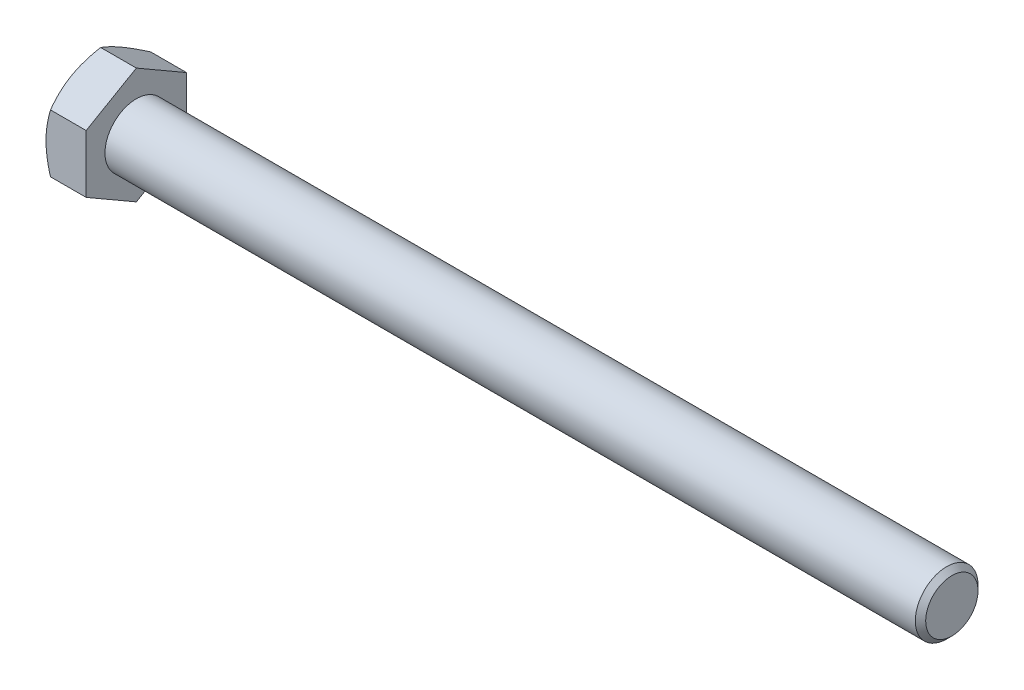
ISO-10303-21;
HEADER;
FILE_DESCRIPTION(('STEP AP214'),'2;1');
FILE_NAME('part.step','',(''),(''),'','','');
FILE_SCHEMA(('AUTOMOTIVE_DESIGN { 1 0 10303 214 1 1 1 1 }'));
ENDSEC;
DATA;
#1=APPLICATION_CONTEXT('core data for automotive mechanical design processes');
#2=APPLICATION_PROTOCOL_DEFINITION('international standard','automotive_design',2000,#1);
#3=PRODUCT_CONTEXT('',#1,'mechanical');
#4=PRODUCT('Part','Part','',(#3));
#5=PRODUCT_RELATED_PRODUCT_CATEGORY('part','',(#4));
#6=PRODUCT_DEFINITION_FORMATION('','',#4);
#7=PRODUCT_DEFINITION_CONTEXT('part definition',#1,'design');
#8=PRODUCT_DEFINITION('design','',#6,#7);
#9=PRODUCT_DEFINITION_SHAPE('','',#8);
#10=(LENGTH_UNIT() NAMED_UNIT(*) SI_UNIT(.MILLI.,.METRE.));
#11=(NAMED_UNIT(*) PLANE_ANGLE_UNIT() SI_UNIT($,.RADIAN.));
#12=(NAMED_UNIT(*) SI_UNIT($,.STERADIAN.) SOLID_ANGLE_UNIT());
#13=UNCERTAINTY_MEASURE_WITH_UNIT(LENGTH_MEASURE(1.E-05),#10,'distance_accuracy_value','');
#14=(GEOMETRIC_REPRESENTATION_CONTEXT(3) GLOBAL_UNCERTAINTY_ASSIGNED_CONTEXT((#13)) GLOBAL_UNIT_ASSIGNED_CONTEXT((#10,
#11,#12)) REPRESENTATION_CONTEXT('',''));
#15=CARTESIAN_POINT('',(0.,0.,0.));
#16=DIRECTION('',(0.,0.,1.));
#17=DIRECTION('',(1.,0.,0.));
#18=AXIS2_PLACEMENT_3D('',#15,#16,#17);
#19=CARTESIAN_POINT('',(0.,9.23760430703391,1.11022302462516E-13));
#20=DIRECTION('',(1.,0.,0.));
#21=DIRECTION('',(0.,1.,0.));
#22=AXIS2_PLACEMENT_3D('',#19,#20,#21);
#23=PLANE('',#22);
#24=CARTESIAN_POINT('',(0.,0.,0.));
#25=DIRECTION('',(1.,0.,0.));
#26=DIRECTION('',(0.,1.,0.));
#27=AXIS2_PLACEMENT_3D('',#24,#25,#26);
#28=CIRCLE('',#27,8.00000000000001);
#29=CARTESIAN_POINT('',(0.,-6.92820323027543,-4.));
#30=VERTEX_POINT('',#29);
#31=CARTESIAN_POINT('',(0.,0.,-7.9999999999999));
#32=VERTEX_POINT('',#31);
#33=EDGE_CURVE('E342',#30,#32,#28,.T.);
#34=ORIENTED_EDGE('',*,*,#33,.F.);
#35=CARTESIAN_POINT('',(0.,0.,0.));
#36=DIRECTION('',(1.,0.,0.));
#37=DIRECTION('',(0.,1.,0.));
#38=AXIS2_PLACEMENT_3D('',#35,#36,#37);
#39=CIRCLE('',#38,8.00000000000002);
#40=CARTESIAN_POINT('',(0.,-6.92820323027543,4.));
#41=VERTEX_POINT('',#40);
#42=EDGE_CURVE('E341',#41,#30,#39,.T.);
#43=ORIENTED_EDGE('',*,*,#42,.F.);
#44=CARTESIAN_POINT('',(0.,0.,0.));
#45=DIRECTION('',(1.,0.,0.));
#46=DIRECTION('',(0.,1.,0.));
#47=AXIS2_PLACEMENT_3D('',#44,#45,#46);
#48=CIRCLE('',#47,8.00000000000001);
#49=CARTESIAN_POINT('',(0.,0.,8.00000000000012));
#50=VERTEX_POINT('',#49);
#51=EDGE_CURVE('E91',#50,#41,#48,.T.);
#52=ORIENTED_EDGE('',*,*,#51,.F.);
#53=CARTESIAN_POINT('',(0.,0.,0.));
#54=DIRECTION('',(1.,0.,0.));
#55=DIRECTION('',(0.,1.,0.));
#56=AXIS2_PLACEMENT_3D('',#53,#54,#55);
#57=CIRCLE('',#56,8.);
#58=CARTESIAN_POINT('',(0.,6.92820323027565,4.00000000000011));
#59=VERTEX_POINT('',#58);
#60=EDGE_CURVE('E89',#59,#50,#57,.T.);
#61=ORIENTED_EDGE('',*,*,#60,.F.);
#62=CARTESIAN_POINT('',(0.,0.,0.));
#63=DIRECTION('',(1.,0.,0.));
#64=DIRECTION('',(0.,1.,0.));
#65=AXIS2_PLACEMENT_3D('',#62,#63,#64);
#66=CIRCLE('',#65,8.);
#67=CARTESIAN_POINT('',(0.,6.92820323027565,-4.));
#68=VERTEX_POINT('',#67);
#69=EDGE_CURVE('E22',#68,#59,#66,.T.);
#70=ORIENTED_EDGE('',*,*,#69,.F.);
#71=CARTESIAN_POINT('',(0.,0.,0.));
#72=DIRECTION('',(1.,0.,0.));
#73=DIRECTION('',(0.,1.,0.));
#74=AXIS2_PLACEMENT_3D('',#71,#72,#73);
#75=CIRCLE('',#74,7.99999999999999);
#76=EDGE_CURVE('E267',#32,#68,#75,.T.);
#77=ORIENTED_EDGE('',*,*,#76,.F.);
#78=EDGE_LOOP('',(#34,#43,#52,#61,#70,#77));
#79=FACE_BOUND('',#78,.T.);
#80=ADVANCED_FACE('F19',(#79),#23,.F.);
#81=CARTESIAN_POINT('',(0.718818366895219,0.,0.));
#82=DIRECTION('',(1.,0.,0.));
#83=DIRECTION('',(0.,1.,0.));
#84=AXIS2_PLACEMENT_3D('',#81,#82,#83);
#85=CONICAL_SURFACE('',#84,9.24502993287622,1.0471975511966);
#86=CARTESIAN_POINT('',(0.714531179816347,9.23760430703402,0.));
#87=CARTESIAN_POINT('',(0.605971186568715,9.04962004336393,-0.325598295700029));
#88=CARTESIAN_POINT('',(0.506511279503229,8.86013033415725,-0.653804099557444));
#89=CARTESIAN_POINT('',(0.331115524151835,8.47948058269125,-1.31310880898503));
#90=CARTESIAN_POINT('',(0.255063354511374,8.28833381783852,-1.64418471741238));
#91=CARTESIAN_POINT('',(0.161684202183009,7.99980970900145,-2.14392313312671));
#92=CARTESIAN_POINT('',(0.133996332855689,7.90327053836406,-2.31113388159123));
#93=CARTESIAN_POINT('',(0.0860680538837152,7.7097300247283,-2.64635588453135));
#94=CARTESIAN_POINT('',(0.0658274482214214,7.61272869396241,-2.81436711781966));
#95=CARTESIAN_POINT('',(0.0331493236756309,7.41790506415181,-3.1518115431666));
#96=CARTESIAN_POINT('',(0.0207514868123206,7.32008108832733,-3.32124763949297));
#97=CARTESIAN_POINT('',(0.00415966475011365,7.1242407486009,-3.66045305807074));
#98=CARTESIAN_POINT('',(-3.26957019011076E-05,7.02622435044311,-3.83022243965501));
#99=CARTESIAN_POINT('',(0.,6.92820323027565,-4.));
#100=B_SPLINE_CURVE_WITH_KNOTS('',3,(#86,#87,#88,#89,#90,#91,#92,#93,#94,#95,#96,#97,#98,#99),
.UNSPECIFIED.,.F.,.F.,(4,2,2,2,2,2,4),(0.,1.17445865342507,2.34298309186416,2.92801198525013,
3.51302547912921,4.1009757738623,4.6890424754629),.UNSPECIFIED.);
#101=CARTESIAN_POINT('',(0.714531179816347,9.23760430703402,0.));
#102=VERTEX_POINT('',#101);
#103=EDGE_CURVE('E101',#102,#68,#100,.T.);
#104=ORIENTED_EDGE('',*,*,#103,.T.);
#105=ORIENTED_EDGE('',*,*,#69,.T.);
#106=CARTESIAN_POINT('',(0.,6.92820323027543,4.00000000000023));
#107=CARTESIAN_POINT('',(-3.26957018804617E-05,7.02622435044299,3.83022243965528));
#108=CARTESIAN_POINT('',(0.00415966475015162,7.12424074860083,3.66045305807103));
#109=CARTESIAN_POINT('',(0.0207514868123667,7.3200810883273,3.32124763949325));
#110=CARTESIAN_POINT('',(0.033149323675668,7.41790506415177,3.15181154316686));
#111=CARTESIAN_POINT('',(0.0658274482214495,7.61272869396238,2.8143671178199));
#112=CARTESIAN_POINT('',(0.0860680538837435,7.70973002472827,2.64635588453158));
#113=CARTESIAN_POINT('',(0.133996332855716,7.90327053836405,2.31113388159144));
#114=CARTESIAN_POINT('',(0.161684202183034,7.99980970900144,2.14392313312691));
#115=CARTESIAN_POINT('',(0.255063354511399,8.28833381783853,1.64418471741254));
#116=CARTESIAN_POINT('',(0.331115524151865,8.47948058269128,1.31310880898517));
#117=CARTESIAN_POINT('',(0.506511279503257,8.8601303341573,0.653804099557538));
#118=CARTESIAN_POINT('',(0.605971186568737,9.04962004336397,0.325598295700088));
#119=CARTESIAN_POINT('',(0.714531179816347,9.23760430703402,0.));
#120=B_SPLINE_CURVE_WITH_KNOTS('',3,(#106,#107,#108,#109,#110,#111,#112,#113,#114,#115,#116,
#117,#118,#119),.UNSPECIFIED.,.F.,.F.,(4,2,2,2,2,2,4),(0.,0.588066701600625,1.17601699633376,
1.76103049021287,2.34605938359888,3.51458382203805,4.68904247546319),.UNSPECIFIED.);
#121=EDGE_CURVE('E99',#59,#102,#120,.T.);
#122=ORIENTED_EDGE('',*,*,#121,.T.);
#123=EDGE_LOOP('',(#104,#105,#122));
#124=FACE_BOUND('',#123,.T.);
#125=ADVANCED_FACE('F97',(#124),#85,.T.);
#126=CARTESIAN_POINT('',(0.718818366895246,0.,0.));
#127=DIRECTION('',(1.,0.,0.));
#128=DIRECTION('',(0.,1.,0.));
#129=AXIS2_PLACEMENT_3D('',#126,#127,#128);
#130=CONICAL_SURFACE('',#129,9.24502993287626,1.0471975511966);
#131=CARTESIAN_POINT('',(0.714531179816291,4.61880215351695,8.00000000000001));
#132=CARTESIAN_POINT('',(0.605971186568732,4.80678641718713,7.67440170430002));
#133=CARTESIAN_POINT('',(0.506511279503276,4.99627612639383,7.34619590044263));
#134=CARTESIAN_POINT('',(0.331115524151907,5.37692587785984,6.68689119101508));
#135=CARTESIAN_POINT('',(0.25506335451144,5.56807264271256,6.35581528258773));
#136=CARTESIAN_POINT('',(0.161684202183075,5.85659675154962,5.85607686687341));
#137=CARTESIAN_POINT('',(0.133996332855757,5.953135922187,5.6888661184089));
#138=CARTESIAN_POINT('',(0.0860680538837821,6.14667643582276,5.35364411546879));
#139=CARTESIAN_POINT('',(0.0658274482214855,6.24367776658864,5.18563288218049));
#140=CARTESIAN_POINT('',(0.033149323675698,6.43850139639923,4.84818845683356));
#141=CARTESIAN_POINT('',(0.0207514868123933,6.53632537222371,4.67875236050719));
#142=CARTESIAN_POINT('',(0.00415966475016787,6.73216571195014,4.33954694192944));
#143=CARTESIAN_POINT('',(-3.26957018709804E-05,6.83018211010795,4.16977756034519));
#144=CARTESIAN_POINT('',(0.,6.92820323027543,4.00000000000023));
#145=B_SPLINE_CURVE_WITH_KNOTS('',3,(#131,#132,#133,#134,#135,#136,#137,#138,#139,#140,#141,
#142,#143,#144),.UNSPECIFIED.,.F.,.F.,(4,2,2,2,2,2,4),(0.,1.17445865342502,2.34298309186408,
2.92801198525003,3.51302547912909,4.10097577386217,4.68904247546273),.UNSPECIFIED.);
#146=CARTESIAN_POINT('',(0.714531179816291,4.61880215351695,8.00000000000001));
#147=VERTEX_POINT('',#146);
#148=EDGE_CURVE('E104',#147,#59,#145,.T.);
#149=ORIENTED_EDGE('',*,*,#148,.T.);
#150=ORIENTED_EDGE('',*,*,#60,.T.);
#151=CARTESIAN_POINT('',(0.,0.,8.00000000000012));
#152=CARTESIAN_POINT('',(-3.26957019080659E-05,0.196042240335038,8.00000000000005));
#153=CARTESIAN_POINT('',(0.00415966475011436,0.39207503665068,8.00000000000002));
#154=CARTESIAN_POINT('',(0.0207514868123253,0.783755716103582,8.));
#155=CARTESIAN_POINT('',(0.0331493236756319,0.979403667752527,8.));
#156=CARTESIAN_POINT('',(0.0658274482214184,1.36905092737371,8.00000000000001));
#157=CARTESIAN_POINT('',(0.086068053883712,1.56305358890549,8.00000000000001));
#158=CARTESIAN_POINT('',(0.133996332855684,1.95013461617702,8.00000000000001));
#159=CARTESIAN_POINT('',(0.161684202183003,2.14321295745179,8.00000000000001));
#160=CARTESIAN_POINT('',(0.255063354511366,2.72026117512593,8.00000000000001));
#161=CARTESIAN_POINT('',(0.331115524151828,3.10255470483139,8.00000000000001));
#162=CARTESIAN_POINT('',(0.506511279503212,3.8638542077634,8.00000000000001));
#163=CARTESIAN_POINT('',(0.605971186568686,4.24283362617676,8.00000000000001));
#164=CARTESIAN_POINT('',(0.714531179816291,4.61880215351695,8.00000000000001));
#165=B_SPLINE_CURVE_WITH_KNOTS('',3,(#151,#152,#153,#154,#155,#156,#157,#158,#159,#160,#161,
#162,#163,#164),.UNSPECIFIED.,.F.,.F.,(4,2,2,2,2,2,4),(0.,0.58806670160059,1.17601699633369,
1.76103049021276,2.34605938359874,3.51458382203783,4.6890424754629),.UNSPECIFIED.);
#166=EDGE_CURVE('E107',#50,#147,#165,.T.);
#167=ORIENTED_EDGE('',*,*,#166,.T.);
#168=EDGE_LOOP('',(#149,#150,#167));
#169=FACE_BOUND('',#168,.T.);
#170=ADVANCED_FACE('F105',(#169),#130,.T.);
#171=CARTESIAN_POINT('',(0.718818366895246,0.,0.));
#172=DIRECTION('',(1.,0.,0.));
#173=DIRECTION('',(0.,1.,0.));
#174=AXIS2_PLACEMENT_3D('',#171,#172,#173);
#175=CONICAL_SURFACE('',#174,9.24502993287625,1.0471975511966);
#176=ORIENTED_EDGE('',*,*,#51,.T.);
#177=CARTESIAN_POINT('',(0.,-6.92820323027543,4.));
#178=CARTESIAN_POINT('',(-3.2695701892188E-05,-6.83018211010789,4.16977756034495));
#179=CARTESIAN_POINT('',(0.00415966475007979,-6.73216571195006,4.33954694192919));
#180=CARTESIAN_POINT('',(0.0207514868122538,-6.53632537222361,4.67875236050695));
#181=CARTESIAN_POINT('',(0.033149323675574,-6.43850139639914,4.84818845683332));
#182=CARTESIAN_POINT('',(0.0658274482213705,-6.24367776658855,5.18563288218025));
#183=CARTESIAN_POINT('',(0.0860680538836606,-6.14667643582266,5.35364411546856));
#184=CARTESIAN_POINT('',(0.13399633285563,-5.9531359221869,5.68886611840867));
#185=CARTESIAN_POINT('',(0.16168420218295,-5.85659675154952,5.85607686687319));
#186=CARTESIAN_POINT('',(0.25506335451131,-5.56807264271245,6.35581528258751));
#187=CARTESIAN_POINT('',(0.331115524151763,-5.37692587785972,6.68689119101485));
#188=CARTESIAN_POINT('',(0.506511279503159,-4.99627612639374,7.34619590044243));
#189=CARTESIAN_POINT('',(0.605971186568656,-4.80678641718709,7.67440170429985));
#190=CARTESIAN_POINT('',(0.714531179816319,-4.61880215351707,7.9999999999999));
#191=B_SPLINE_CURVE_WITH_KNOTS('',3,(#177,#178,#179,#180,#181,#182,#183,#184,#185,#186,#187,
#188,#189,#190),.UNSPECIFIED.,.F.,.F.,(4,2,2,2,2,2,4),(0.,0.588066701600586,1.17601699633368,
1.76103049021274,2.3460593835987,3.51458382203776,4.68904247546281),.UNSPECIFIED.);
#192=CARTESIAN_POINT('',(0.714531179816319,-4.61880215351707,7.9999999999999));
#193=VERTEX_POINT('',#192);
#194=EDGE_CURVE('E182',#41,#193,#191,.T.);
#195=ORIENTED_EDGE('',*,*,#194,.T.);
#196=CARTESIAN_POINT('',(0.714531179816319,-4.61880215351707,7.9999999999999));
#197=CARTESIAN_POINT('',(0.605971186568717,-4.24283362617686,7.99999999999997));
#198=CARTESIAN_POINT('',(0.50651127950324,-3.8638542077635,8.));
#199=CARTESIAN_POINT('',(0.33111552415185,-3.10255470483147,8.00000000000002));
#200=CARTESIAN_POINT('',(0.255063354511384,-2.72026117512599,8.00000000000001));
#201=CARTESIAN_POINT('',(0.161684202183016,-2.14321295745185,8.00000000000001));
#202=CARTESIAN_POINT('',(0.133996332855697,-1.95013461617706,8.00000000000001));
#203=CARTESIAN_POINT('',(0.0860680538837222,-1.56305358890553,8.00000000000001));
#204=CARTESIAN_POINT('',(0.0658274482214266,-1.36905092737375,8.00000000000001));
#205=CARTESIAN_POINT('',(0.0331493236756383,-0.979403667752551,8.));
#206=CARTESIAN_POINT('',(0.0207514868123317,-0.7837557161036,8.));
#207=CARTESIAN_POINT('',(0.0041596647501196,-0.392075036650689,8.00000000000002));
#208=CARTESIAN_POINT('',(-3.26957019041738E-05,-0.196042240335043,8.00000000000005));
#209=CARTESIAN_POINT('',(0.,0.,8.00000000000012));
#210=B_SPLINE_CURVE_WITH_KNOTS('',3,(#196,#197,#198,#199,#200,#201,#202,#203,#204,#205,#206,
#207,#208,#209),.UNSPECIFIED.,.F.,.F.,(4,2,2,2,2,2,4),(0.,1.17445865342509,2.34298309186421,
2.9280119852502,3.51302547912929,4.10097577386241,4.68904247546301),.UNSPECIFIED.);
#211=EDGE_CURVE('E154',#193,#50,#210,.T.);
#212=ORIENTED_EDGE('',*,*,#211,.T.);
#213=EDGE_LOOP('',(#176,#195,#212));
#214=FACE_BOUND('',#213,.T.);
#215=ADVANCED_FACE('F144',(#214),#175,.T.);
#216=CARTESIAN_POINT('',(0.718818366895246,0.,0.));
#217=DIRECTION('',(1.,0.,0.));
#218=DIRECTION('',(0.,1.,0.));
#219=AXIS2_PLACEMENT_3D('',#216,#217,#218);
#220=CONICAL_SURFACE('',#219,9.24502993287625,1.0471975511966);
#221=ORIENTED_EDGE('',*,*,#42,.T.);
#222=CARTESIAN_POINT('',(0.,-6.92820323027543,-4.));
#223=CARTESIAN_POINT('',(-3.26957019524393E-05,-7.02622435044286,-3.83022243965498));
#224=CARTESIAN_POINT('',(0.00415966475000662,-7.12424074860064,-3.66045305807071));
#225=CARTESIAN_POINT('',(0.0207514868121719,-7.32008108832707,-3.32124763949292));
#226=CARTESIAN_POINT('',(0.0331493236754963,-7.41790506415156,-3.15181154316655));
#227=CARTESIAN_POINT('',(0.065827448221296,-7.61272869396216,-2.81436711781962));
#228=CARTESIAN_POINT('',(0.0860680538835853,-7.70973002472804,-2.6463558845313));
#229=CARTESIAN_POINT('',(0.133996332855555,-7.90327053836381,-2.31113388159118));
#230=CARTESIAN_POINT('',(0.161684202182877,-7.99980970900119,-2.14392313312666));
#231=CARTESIAN_POINT('',(0.255063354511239,-8.28833381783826,-1.64418471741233));
#232=CARTESIAN_POINT('',(0.331115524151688,-8.47948058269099,-1.31310880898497));
#233=CARTESIAN_POINT('',(0.50651127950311,-8.860130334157,-0.653804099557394));
#234=CARTESIAN_POINT('',(0.605971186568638,-9.04962004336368,-0.325598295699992));
#235=CARTESIAN_POINT('',(0.714531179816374,-9.2376043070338,0.));
#236=B_SPLINE_CURVE_WITH_KNOTS('',3,(#222,#223,#224,#225,#226,#227,#228,#229,#230,#231,#232,
#233,#234,#235),.UNSPECIFIED.,.F.,.F.,(4,2,2,2,2,2,4),(0.,0.588066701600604,1.17601699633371,
1.76103049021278,2.34605938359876,3.51458382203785,4.68904247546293),.UNSPECIFIED.);
#237=CARTESIAN_POINT('',(0.714531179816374,-9.2376043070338,0.));
#238=VERTEX_POINT('',#237);
#239=EDGE_CURVE('E314',#30,#238,#236,.T.);
#240=ORIENTED_EDGE('',*,*,#239,.T.);
#241=CARTESIAN_POINT('',(0.714531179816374,-9.23760430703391,0.));
#242=CARTESIAN_POINT('',(0.605971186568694,-9.04962004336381,0.325598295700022));
#243=CARTESIAN_POINT('',(0.506511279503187,-8.86013033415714,0.653804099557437));
#244=CARTESIAN_POINT('',(0.331115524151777,-8.47948058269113,1.31310880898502));
#245=CARTESIAN_POINT('',(0.255063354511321,-8.2883338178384,1.64418471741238));
#246=CARTESIAN_POINT('',(0.161684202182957,-7.99980970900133,2.14392313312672));
#247=CARTESIAN_POINT('',(0.133996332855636,-7.90327053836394,2.31113388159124));
#248=CARTESIAN_POINT('',(0.0860680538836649,-7.70973002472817,2.64635588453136));
#249=CARTESIAN_POINT('',(0.0658274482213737,-7.61272869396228,2.81436711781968));
#250=CARTESIAN_POINT('',(0.0331493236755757,-7.41790506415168,3.15181154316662));
#251=CARTESIAN_POINT('',(0.0207514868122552,-7.3200810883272,3.321247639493));
#252=CARTESIAN_POINT('',(0.00415966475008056,-7.12424074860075,3.66045305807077));
#253=CARTESIAN_POINT('',(-3.26957018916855E-05,-7.02622435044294,3.83022243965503));
#254=CARTESIAN_POINT('',(0.,-6.92820323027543,4.));
#255=B_SPLINE_CURVE_WITH_KNOTS('',3,(#241,#242,#243,#244,#245,#246,#247,#248,#249,#250,#251,
#252,#253,#254),.UNSPECIFIED.,.F.,.F.,(4,2,2,2,2,2,4),(0.,1.17445865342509,2.34298309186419,
2.92801198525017,3.51302547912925,4.10097577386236,4.68904247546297),.UNSPECIFIED.);
#256=EDGE_CURVE('E176',#238,#41,#255,.T.);
#257=ORIENTED_EDGE('',*,*,#256,.T.);
#258=EDGE_LOOP('',(#221,#240,#257));
#259=FACE_BOUND('',#258,.T.);
#260=ADVANCED_FACE('F332',(#259),#220,.T.);
#261=CARTESIAN_POINT('',(0.718818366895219,0.,0.));
#262=DIRECTION('',(1.,0.,0.));
#263=DIRECTION('',(0.,1.,0.));
#264=AXIS2_PLACEMENT_3D('',#261,#262,#263);
#265=CONICAL_SURFACE('',#264,9.24502993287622,1.0471975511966);
#266=ORIENTED_EDGE('',*,*,#33,.T.);
#267=CARTESIAN_POINT('',(0.,0.,-7.9999999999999));
#268=CARTESIAN_POINT('',(-3.26957019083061E-05,-0.196042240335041,-7.9999999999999));
#269=CARTESIAN_POINT('',(0.00415966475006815,-0.392075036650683,-7.9999999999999));
#270=CARTESIAN_POINT('',(0.0207514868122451,-0.783755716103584,-7.9999999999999));
#271=CARTESIAN_POINT('',(0.0331493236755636,-0.979403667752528,-7.9999999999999));
#272=CARTESIAN_POINT('',(0.0658274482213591,-1.36905092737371,-7.9999999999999));
#273=CARTESIAN_POINT('',(0.0860680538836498,-1.56305358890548,-7.9999999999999));
#274=CARTESIAN_POINT('',(0.13399633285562,-1.950134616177,-7.9999999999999));
#275=CARTESIAN_POINT('',(0.16168420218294,-2.14321295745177,-7.9999999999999));
#276=CARTESIAN_POINT('',(0.255063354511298,-2.7202611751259,-7.9999999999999));
#277=CARTESIAN_POINT('',(0.331115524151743,-3.10255470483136,-7.9999999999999));
#278=CARTESIAN_POINT('',(0.506511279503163,-3.86385420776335,-7.9999999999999));
#279=CARTESIAN_POINT('',(0.60597118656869,-4.24283362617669,-7.9999999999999));
#280=CARTESIAN_POINT('',(0.71453117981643,-4.61880215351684,-7.9999999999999));
#281=B_SPLINE_CURVE_WITH_KNOTS('',3,(#267,#268,#269,#270,#271,#272,#273,#274,#275,#276,#277,
#278,#279,#280),.UNSPECIFIED.,.F.,.F.,(4,2,2,2,2,2,4),(0.,0.58806670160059,1.17601699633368,
1.76103049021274,2.34605938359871,3.51458382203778,4.68904247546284),.UNSPECIFIED.);
#282=CARTESIAN_POINT('',(0.714531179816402,-4.61880215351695,-7.99999999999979));
#283=VERTEX_POINT('',#282);
#284=EDGE_CURVE('E243',#32,#283,#281,.T.);
#285=ORIENTED_EDGE('',*,*,#284,.T.);
#286=CARTESIAN_POINT('',(0.714531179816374,-4.61880215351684,-7.99999999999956));
#287=CARTESIAN_POINT('',(0.605971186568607,-4.80678641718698,-7.67440170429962));
#288=CARTESIAN_POINT('',(0.506511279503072,-4.99627612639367,-7.34619590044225));
#289=CARTESIAN_POINT('',(0.331115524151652,-5.37692587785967,-6.68689119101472));
#290=CARTESIAN_POINT('',(0.255063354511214,-5.56807264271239,-6.35581528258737));
#291=CARTESIAN_POINT('',(0.16168420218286,-5.85659675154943,-5.85607686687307));
#292=CARTESIAN_POINT('',(0.13399633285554,-5.95313592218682,-5.68886611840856));
#293=CARTESIAN_POINT('',(0.086068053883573,-6.14667643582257,-5.35364411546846));
#294=CARTESIAN_POINT('',(0.0658274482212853,-6.24367776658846,-5.18563288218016));
#295=CARTESIAN_POINT('',(0.0331493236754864,-6.43850139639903,-4.84818845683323));
#296=CARTESIAN_POINT('',(0.0207514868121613,-6.53632537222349,-4.67875236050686));
#297=CARTESIAN_POINT('',(0.00415966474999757,-6.73216571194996,-4.33954694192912));
#298=CARTESIAN_POINT('',(-3.26957019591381E-05,-6.83018211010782,-4.1697775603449));
#299=CARTESIAN_POINT('',(0.,-6.92820323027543,-4.));
#300=B_SPLINE_CURVE_WITH_KNOTS('',3,(#286,#287,#288,#289,#290,#291,#292,#293,#294,#295,#296,
#297,#298,#299),.UNSPECIFIED.,.F.,.F.,(4,2,2,2,2,2,4),(0.,1.17445865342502,2.34298309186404,
2.92801198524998,3.51302547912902,4.10097577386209,4.68904247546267),.UNSPECIFIED.);
#301=EDGE_CURVE('E313',#283,#30,#300,.T.);
#302=ORIENTED_EDGE('',*,*,#301,.T.);
#303=EDGE_LOOP('',(#266,#285,#302));
#304=FACE_BOUND('',#303,.T.);
#305=ADVANCED_FACE('F258',(#304),#265,.T.);
#306=CARTESIAN_POINT('',(0.718818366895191,0.,0.));
#307=DIRECTION('',(1.,0.,0.));
#308=DIRECTION('',(0.,1.,0.));
#309=AXIS2_PLACEMENT_3D('',#306,#307,#308);
#310=CONICAL_SURFACE('',#309,9.24502993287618,1.0471975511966);
#311=CARTESIAN_POINT('',(0.714531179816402,4.61880215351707,-7.9999999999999));
#312=CARTESIAN_POINT('',(0.605971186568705,4.24283362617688,-7.99999999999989));
#313=CARTESIAN_POINT('',(0.506511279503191,3.86385420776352,-7.9999999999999));
#314=CARTESIAN_POINT('',(0.331115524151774,3.1025547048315,-7.9999999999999));
#315=CARTESIAN_POINT('',(0.255063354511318,2.72026117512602,-7.9999999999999));
#316=CARTESIAN_POINT('',(0.16168420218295,2.14321295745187,-7.9999999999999));
#317=CARTESIAN_POINT('',(0.133996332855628,1.95013461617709,-7.9999999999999));
#318=CARTESIAN_POINT('',(0.0860680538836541,1.56305358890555,-7.9999999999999));
#319=CARTESIAN_POINT('',(0.0658274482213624,1.36905092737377,-7.9999999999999));
#320=CARTESIAN_POINT('',(0.0331493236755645,0.979403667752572,-7.9999999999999));
#321=CARTESIAN_POINT('',(0.0207514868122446,0.783755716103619,-7.9999999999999));
#322=CARTESIAN_POINT('',(0.00415966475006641,0.392075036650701,-7.9999999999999));
#323=CARTESIAN_POINT('',(-3.26957019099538E-05,0.196042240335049,-7.9999999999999));
#324=CARTESIAN_POINT('',(0.,0.,-7.9999999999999));
#325=B_SPLINE_CURVE_WITH_KNOTS('',3,(#311,#312,#313,#314,#315,#316,#317,#318,#319,#320,#321,
#322,#323,#324),.UNSPECIFIED.,.F.,.F.,(4,2,2,2,2,2,4),(0.,1.17445865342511,2.34298309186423,
2.92801198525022,3.51302547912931,4.10097577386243,4.68904247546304),.UNSPECIFIED.);
#326=CARTESIAN_POINT('',(0.714531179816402,4.61880215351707,-7.9999999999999));
#327=VERTEX_POINT('',#326);
#328=EDGE_CURVE('E234',#327,#32,#325,.T.);
#329=ORIENTED_EDGE('',*,*,#328,.T.);
#330=ORIENTED_EDGE('',*,*,#76,.T.);
#331=CARTESIAN_POINT('',(0.,6.92820323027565,-4.));
#332=CARTESIAN_POINT('',(-3.26957019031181E-05,6.83018211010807,-4.16977756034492));
#333=CARTESIAN_POINT('',(0.00415966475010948,6.73216571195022,-4.33954694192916));
#334=CARTESIAN_POINT('',(0.0207514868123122,6.53632537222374,-4.67875236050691));
#335=CARTESIAN_POINT('',(0.0331493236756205,6.43850139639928,-4.84818845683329));
#336=CARTESIAN_POINT('',(0.0658274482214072,6.24367776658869,-5.18563288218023));
#337=CARTESIAN_POINT('',(0.0860680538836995,6.1466764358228,-5.35364411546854));
#338=CARTESIAN_POINT('',(0.13399633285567,5.95313592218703,-5.68886611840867));
#339=CARTESIAN_POINT('',(0.161684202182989,5.85659675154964,-5.85607686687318));
#340=CARTESIAN_POINT('',(0.255063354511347,5.56807264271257,-6.35581528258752));
#341=CARTESIAN_POINT('',(0.331115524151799,5.37692587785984,-6.68689119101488));
#342=CARTESIAN_POINT('',(0.506511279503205,4.99627612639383,-7.34619590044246));
#343=CARTESIAN_POINT('',(0.605971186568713,4.80678641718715,-7.67440170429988));
#344=CARTESIAN_POINT('',(0.714531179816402,4.61880215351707,-7.9999999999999));
#345=B_SPLINE_CURVE_WITH_KNOTS('',3,(#331,#332,#333,#334,#335,#336,#337,#338,#339,#340,#341,
#342,#343,#344),.UNSPECIFIED.,.F.,.F.,(4,2,2,2,2,2,4),(0.,0.588066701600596,1.1760169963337,
1.76103049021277,2.34605938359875,3.51458382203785,4.68904247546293),.UNSPECIFIED.);
#346=EDGE_CURVE('E117',#68,#327,#345,.T.);
#347=ORIENTED_EDGE('',*,*,#346,.T.);
#348=EDGE_LOOP('',(#329,#330,#347));
#349=FACE_BOUND('',#348,.T.);
#350=ADVANCED_FACE('F253',(#349),#310,.T.);
#351=CARTESIAN_POINT('',(136.4,0.,0.));
#352=DIRECTION('',(-1.,0.,0.));
#353=DIRECTION('',(0.,-1.,0.));
#354=AXIS2_PLACEMENT_3D('',#351,#352,#353);
#355=PLANE('',#354);
#356=CARTESIAN_POINT('',(136.399999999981,0.,0.));
#357=DIRECTION('',(-1.,0.,0.));
#358=DIRECTION('',(0.,0.,1.));
#359=AXIS2_PLACEMENT_3D('',#356,#357,#358);
#360=CIRCLE('',#359,4.17199999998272);
#361=CARTESIAN_POINT('',(136.399999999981,0.,4.17199999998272));
#362=VERTEX_POINT('',#361);
#363=EDGE_CURVE('E205',#362,#362,#360,.T.);
#364=ORIENTED_EDGE('',*,*,#363,.F.);
#365=EDGE_LOOP('',(#364));
#366=FACE_BOUND('',#365,.T.);
#367=ADVANCED_FACE('F257',(#366),#355,.F.);
#368=CARTESIAN_POINT('',(6.40000000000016,4.61880215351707,-7.9999999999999));
#369=DIRECTION('',(0.,-0.866025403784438,0.500000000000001));
#370=DIRECTION('',(0.,-0.500000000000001,-0.866025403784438));
#371=AXIS2_PLACEMENT_3D('',#368,#369,#370);
#372=PLANE('',#371);
#373=DIRECTION('',(1.,0.,0.));
#374=VECTOR('',#373,1.);
#375=CARTESIAN_POINT('',(6.40000000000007,9.23760430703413,0.));
#376=LINE('',#375,#374);
#377=CARTESIAN_POINT('',(6.40000000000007,9.23760430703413,0.));
#378=VERTEX_POINT('',#377);
#379=EDGE_CURVE('E110',#102,#378,#376,.T.);
#380=ORIENTED_EDGE('',*,*,#379,.T.);
#381=DIRECTION('',(0.,0.500000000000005,0.866025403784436));
#382=VECTOR('',#381,1.);
#383=CARTESIAN_POINT('',(6.40000000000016,4.61880215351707,-7.9999999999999));
#384=LINE('',#383,#382);
#385=CARTESIAN_POINT('',(6.40000000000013,4.61880215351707,-7.9999999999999));
#386=VERTEX_POINT('',#385);
#387=EDGE_CURVE('E201',#386,#378,#384,.T.);
#388=ORIENTED_EDGE('',*,*,#387,.F.);
#389=DIRECTION('',(1.,0.,0.));
#390=VECTOR('',#389,1.);
#391=CARTESIAN_POINT('',(6.40000000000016,4.61880215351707,-7.9999999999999));
#392=LINE('',#391,#390);
#393=EDGE_CURVE('E242',#386,#327,#392,.F.);
#394=ORIENTED_EDGE('',*,*,#393,.T.);
#395=ORIENTED_EDGE('',*,*,#346,.F.);
#396=ORIENTED_EDGE('',*,*,#103,.F.);
#397=EDGE_LOOP('',(#380,#388,#394,#395,#396));
#398=FACE_BOUND('',#397,.T.);
#399=ADVANCED_FACE('F269',(#398),#372,.F.);
#400=CARTESIAN_POINT('',(6.40000000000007,9.23760430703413,0.));
#401=DIRECTION('',(0.,-0.866025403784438,-0.500000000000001));
#402=DIRECTION('',(0.,0.500000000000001,-0.866025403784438));
#403=AXIS2_PLACEMENT_3D('',#400,#401,#402);
#404=PLANE('',#403);
#405=DIRECTION('',(-1.,0.,0.));
#406=VECTOR('',#405,1.);
#407=CARTESIAN_POINT('',(6.39999999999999,4.61880215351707,8.00000000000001));
#408=LINE('',#407,#406);
#409=CARTESIAN_POINT('',(6.39999999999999,4.61880215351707,8.00000000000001));
#410=VERTEX_POINT('',#409);
#411=EDGE_CURVE('E153',#147,#410,#408,.F.);
#412=ORIENTED_EDGE('',*,*,#411,.T.);
#413=DIRECTION('',(0.,-0.499999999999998,0.866025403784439));
#414=VECTOR('',#413,1.);
#415=CARTESIAN_POINT('',(6.40000000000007,9.23760430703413,0.));
#416=LINE('',#415,#414);
#417=EDGE_CURVE('E204',#378,#410,#416,.T.);
#418=ORIENTED_EDGE('',*,*,#417,.F.);
#419=ORIENTED_EDGE('',*,*,#379,.F.);
#420=ORIENTED_EDGE('',*,*,#121,.F.);
#421=ORIENTED_EDGE('',*,*,#148,.F.);
#422=EDGE_LOOP('',(#412,#418,#419,#420,#421));
#423=FACE_BOUND('',#422,.T.);
#424=ADVANCED_FACE('F113',(#423),#404,.F.);
#425=CARTESIAN_POINT('',(6.39999999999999,4.61880215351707,8.00000000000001));
#426=DIRECTION('',(0.,0.,-1.));
#427=DIRECTION('',(-1.,0.,0.));
#428=AXIS2_PLACEMENT_3D('',#425,#426,#427);
#429=PLANE('',#428);
#430=DIRECTION('',(1.,0.,0.));
#431=VECTOR('',#430,1.);
#432=CARTESIAN_POINT('',(6.39999999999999,-4.61880215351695,8.00000000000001));
#433=LINE('',#432,#431);
#434=CARTESIAN_POINT('',(6.40000000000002,-4.61880215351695,8.00000000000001));
#435=VERTEX_POINT('',#434);
#436=EDGE_CURVE('E187',#193,#435,#433,.T.);
#437=ORIENTED_EDGE('',*,*,#436,.T.);
#438=DIRECTION('',(0.,1.,0.));
#439=VECTOR('',#438,1.);
#440=CARTESIAN_POINT('',(6.40000000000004,9.23760430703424,8.00000000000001));
#441=LINE('',#440,#439);
#442=EDGE_CURVE('E221',#410,#435,#441,.F.);
#443=ORIENTED_EDGE('',*,*,#442,.F.);
#444=ORIENTED_EDGE('',*,*,#411,.F.);
#445=ORIENTED_EDGE('',*,*,#166,.F.);
#446=ORIENTED_EDGE('',*,*,#211,.F.);
#447=EDGE_LOOP('',(#437,#443,#444,#445,#446));
#448=FACE_BOUND('',#447,.T.);
#449=ADVANCED_FACE('F160',(#448),#429,.F.);
#450=CARTESIAN_POINT('',(6.40000000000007,-9.23760430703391,0.));
#451=DIRECTION('',(0.,0.866025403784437,-0.500000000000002));
#452=DIRECTION('',(0.,0.500000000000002,0.866025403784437));
#453=AXIS2_PLACEMENT_3D('',#450,#451,#452);
#454=PLANE('',#453);
#455=DIRECTION('',(1.,0.,0.));
#456=VECTOR('',#455,1.);
#457=CARTESIAN_POINT('',(6.40000000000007,-9.23760430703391,0.));
#458=LINE('',#457,#456);
#459=CARTESIAN_POINT('',(6.40000000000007,-9.23760430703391,0.));
#460=VERTEX_POINT('',#459);
#461=EDGE_CURVE('E311',#238,#460,#458,.T.);
#462=ORIENTED_EDGE('',*,*,#461,.T.);
#463=DIRECTION('',(0.,-0.500000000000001,-0.866025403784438));
#464=VECTOR('',#463,1.);
#465=CARTESIAN_POINT('',(6.40000000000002,-4.61880215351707,7.9999999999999));
#466=LINE('',#465,#464);
#467=EDGE_CURVE('E216',#435,#460,#466,.T.);
#468=ORIENTED_EDGE('',*,*,#467,.F.);
#469=ORIENTED_EDGE('',*,*,#436,.F.);
#470=ORIENTED_EDGE('',*,*,#194,.F.);
#471=ORIENTED_EDGE('',*,*,#256,.F.);
#472=EDGE_LOOP('',(#462,#468,#469,#470,#471));
#473=FACE_BOUND('',#472,.T.);
#474=ADVANCED_FACE('F164',(#473),#454,.F.);
#475=CARTESIAN_POINT('',(6.40000000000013,-4.61880215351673,-8.00000000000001));
#476=DIRECTION('',(0.,0.866025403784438,0.5));
#477=DIRECTION('',(0.,-0.5,0.866025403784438));
#478=AXIS2_PLACEMENT_3D('',#475,#476,#477);
#479=PLANE('',#478);
#480=DIRECTION('',(1.,0.,0.));
#481=VECTOR('',#480,1.);
#482=CARTESIAN_POINT('',(6.40000000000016,-4.61880215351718,-7.9999999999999));
#483=LINE('',#482,#481);
#484=CARTESIAN_POINT('',(6.40000000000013,-4.61880215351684,-7.9999999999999));
#485=VERTEX_POINT('',#484);
#486=EDGE_CURVE('E37',#283,#485,#483,.T.);
#487=ORIENTED_EDGE('',*,*,#486,.T.);
#488=DIRECTION('',(0.,0.500000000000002,-0.866025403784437));
#489=VECTOR('',#488,1.);
#490=CARTESIAN_POINT('',(6.4000000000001,-9.23760430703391,0.));
#491=LINE('',#490,#489);
#492=EDGE_CURVE('E211',#460,#485,#491,.T.);
#493=ORIENTED_EDGE('',*,*,#492,.F.);
#494=ORIENTED_EDGE('',*,*,#461,.F.);
#495=ORIENTED_EDGE('',*,*,#239,.F.);
#496=ORIENTED_EDGE('',*,*,#301,.F.);
#497=EDGE_LOOP('',(#487,#493,#494,#495,#496));
#498=FACE_BOUND('',#497,.T.);
#499=ADVANCED_FACE('F170',(#498),#479,.F.);
#500=CARTESIAN_POINT('',(6.40000000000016,4.61880215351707,-7.9999999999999));
#501=DIRECTION('',(0.,0.,1.));
#502=DIRECTION('',(0.,-1.,0.));
#503=AXIS2_PLACEMENT_3D('',#500,#501,#502);
#504=PLANE('',#503);
#505=ORIENTED_EDGE('',*,*,#393,.F.);
#506=DIRECTION('',(0.,1.,0.));
#507=VECTOR('',#506,1.);
#508=CARTESIAN_POINT('',(6.40000000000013,9.23760430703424,-8.00000000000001));
#509=LINE('',#508,#507);
#510=EDGE_CURVE('E208',#485,#386,#509,.T.);
#511=ORIENTED_EDGE('',*,*,#510,.F.);
#512=ORIENTED_EDGE('',*,*,#486,.F.);
#513=ORIENTED_EDGE('',*,*,#284,.F.);
#514=ORIENTED_EDGE('',*,*,#328,.F.);
#515=EDGE_LOOP('',(#505,#511,#512,#513,#514));
#516=FACE_BOUND('',#515,.T.);
#517=ADVANCED_FACE('F250',(#516),#504,.F.);
#518=CARTESIAN_POINT('',(135.571999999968,0.,0.));
#519=DIRECTION('',(-1.,0.,0.));
#520=DIRECTION('',(0.,0.,1.));
#521=AXIS2_PLACEMENT_3D('',#518,#519,#520);
#522=CONICAL_SURFACE('',#521,4.99999999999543,0.785398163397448);
#523=ORIENTED_EDGE('',*,*,#363,.T.);
#524=EDGE_LOOP('',(#523));
#525=FACE_BOUND('',#524,.T.);
#526=CARTESIAN_POINT('',(135.572,0.,0.));
#527=DIRECTION('',(-1.,0.,0.));
#528=DIRECTION('',(0.,-1.,0.));
#529=AXIS2_PLACEMENT_3D('',#526,#527,#528);
#530=CIRCLE('',#529,5.);
#531=CARTESIAN_POINT('',(135.572,-5.,0.));
#532=VERTEX_POINT('',#531);
#533=EDGE_CURVE('E28',#532,#532,#530,.T.);
#534=ORIENTED_EDGE('',*,*,#533,.F.);
#535=EDGE_LOOP('',(#534));
#536=FACE_BOUND('',#535,.T.);
#537=ADVANCED_FACE('F288',(#525,#536),#522,.T.);
#538=CARTESIAN_POINT('',(6.40000000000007,9.23760430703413,0.));
#539=DIRECTION('',(1.,0.,0.));
#540=DIRECTION('',(0.,1.,0.));
#541=AXIS2_PLACEMENT_3D('',#538,#539,#540);
#542=PLANE('',#541);
#543=CARTESIAN_POINT('',(6.40000000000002,0.,0.));
#544=DIRECTION('',(-1.,0.,0.));
#545=DIRECTION('',(0.,-1.,0.));
#546=AXIS2_PLACEMENT_3D('',#543,#544,#545);
#547=CIRCLE('',#546,5.);
#548=CARTESIAN_POINT('',(6.40000000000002,-5.,0.));
#549=VERTEX_POINT('',#548);
#550=EDGE_CURVE('E11',#549,#549,#547,.F.);
#551=ORIENTED_EDGE('',*,*,#550,.F.);
#552=EDGE_LOOP('',(#551));
#553=FACE_BOUND('',#552,.T.);
#554=ORIENTED_EDGE('',*,*,#492,.T.);
#555=ORIENTED_EDGE('',*,*,#510,.T.);
#556=ORIENTED_EDGE('',*,*,#387,.T.);
#557=ORIENTED_EDGE('',*,*,#417,.T.);
#558=ORIENTED_EDGE('',*,*,#442,.T.);
#559=ORIENTED_EDGE('',*,*,#467,.T.);
#560=EDGE_LOOP('',(#554,#555,#556,#557,#558,#559));
#561=FACE_BOUND('',#560,.T.);
#562=ADVANCED_FACE('F282',(#553,#561),#542,.T.);
#563=CARTESIAN_POINT('',(0.,0.,0.));
#564=DIRECTION('',(-1.,0.,0.));
#565=DIRECTION('',(0.,-1.,0.));
#566=AXIS2_PLACEMENT_3D('',#563,#564,#565);
#567=CYLINDRICAL_SURFACE('',#566,5.);
#568=ORIENTED_EDGE('',*,*,#533,.T.);
#569=EDGE_LOOP('',(#568));
#570=FACE_BOUND('',#569,.T.);
#571=ORIENTED_EDGE('',*,*,#550,.T.);
#572=EDGE_LOOP('',(#571));
#573=FACE_BOUND('',#572,.T.);
#574=ADVANCED_FACE('F280',(#570,#573),#567,.T.);
#575=CLOSED_SHELL('',(#80,#125,#170,#215,#260,#305,#350,#367,#399,#424,#449,#474,#499,#517,#537,
#562,#574));
#576=MANIFOLD_SOLID_BREP('B1',#575);
#577=ADVANCED_BREP_SHAPE_REPRESENTATION('',(#18,#576),#14);
#578=SHAPE_DEFINITION_REPRESENTATION(#9,#577);
ENDSEC;
END-ISO-10303-21;
